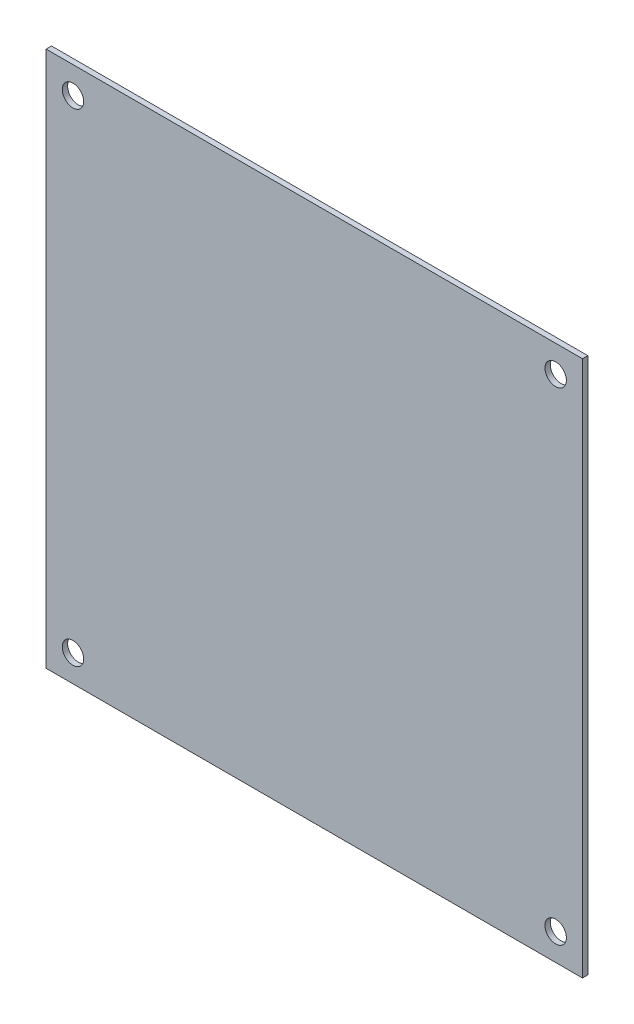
ISO-10303-21;
HEADER;
FILE_DESCRIPTION(('STEP AP214'),'2;1');
FILE_NAME('part.step','',(''),(''),'','','');
FILE_SCHEMA(('AUTOMOTIVE_DESIGN { 1 0 10303 214 1 1 1 1 }'));
ENDSEC;
DATA;
#1=APPLICATION_CONTEXT('core data for automotive mechanical design processes');
#2=APPLICATION_PROTOCOL_DEFINITION('international standard','automotive_design',2000,#1);
#3=PRODUCT_CONTEXT('',#1,'mechanical');
#4=PRODUCT('Part','Part','',(#3));
#5=PRODUCT_RELATED_PRODUCT_CATEGORY('part','',(#4));
#6=PRODUCT_DEFINITION_FORMATION('','',#4);
#7=PRODUCT_DEFINITION_CONTEXT('part definition',#1,'design');
#8=PRODUCT_DEFINITION('design','',#6,#7);
#9=PRODUCT_DEFINITION_SHAPE('','',#8);
#10=(LENGTH_UNIT() NAMED_UNIT(*) SI_UNIT(.MILLI.,.METRE.));
#11=(NAMED_UNIT(*) PLANE_ANGLE_UNIT() SI_UNIT($,.RADIAN.));
#12=(NAMED_UNIT(*) SI_UNIT($,.STERADIAN.) SOLID_ANGLE_UNIT());
#13=UNCERTAINTY_MEASURE_WITH_UNIT(LENGTH_MEASURE(1.E-05),#10,'distance_accuracy_value','');
#14=(GEOMETRIC_REPRESENTATION_CONTEXT(3) GLOBAL_UNCERTAINTY_ASSIGNED_CONTEXT((#13)) GLOBAL_UNIT_ASSIGNED_CONTEXT((#10,
#11,#12)) REPRESENTATION_CONTEXT('',''));
#15=CARTESIAN_POINT('',(0.,0.,0.));
#16=DIRECTION('',(0.,0.,1.));
#17=DIRECTION('',(1.,0.,0.));
#18=AXIS2_PLACEMENT_3D('',#15,#16,#17);
#19=CARTESIAN_POINT('',(0.,0.,5.));
#20=DIRECTION('',(0.,0.,1.));
#21=DIRECTION('',(1.,0.,0.));
#22=AXIS2_PLACEMENT_3D('',#19,#20,#21);
#23=PLANE('',#22);
#24=CARTESIAN_POINT('',(225.,-225.,5.));
#25=DIRECTION('',(0.,0.,1.));
#26=DIRECTION('',(1.,0.,0.));
#27=AXIS2_PLACEMENT_3D('',#24,#25,#26);
#28=CIRCLE('',#27,10.);
#29=CARTESIAN_POINT('',(235.,-225.,5.));
#30=VERTEX_POINT('',#29);
#31=EDGE_CURVE('E142',#30,#30,#28,.T.);
#32=ORIENTED_EDGE('',*,*,#31,.F.);
#33=EDGE_LOOP('',(#32));
#34=FACE_BOUND('',#33,.T.);
#35=CARTESIAN_POINT('',(-225.,225.,5.));
#36=DIRECTION('',(0.,0.,1.));
#37=DIRECTION('',(1.,0.,0.));
#38=AXIS2_PLACEMENT_3D('',#35,#36,#37);
#39=CIRCLE('',#38,10.);
#40=CARTESIAN_POINT('',(-215.,225.,5.));
#41=VERTEX_POINT('',#40);
#42=EDGE_CURVE('E112',#41,#41,#39,.T.);
#43=ORIENTED_EDGE('',*,*,#42,.F.);
#44=EDGE_LOOP('',(#43));
#45=FACE_BOUND('',#44,.T.);
#46=DIRECTION('',(0.,1.,0.));
#47=VECTOR('',#46,1.);
#48=CARTESIAN_POINT('',(250.,250.,5.));
#49=LINE('',#48,#47);
#50=CARTESIAN_POINT('',(250.,-250.,5.));
#51=VERTEX_POINT('',#50);
#52=CARTESIAN_POINT('',(250.,250.,5.));
#53=VERTEX_POINT('',#52);
#54=EDGE_CURVE('E92',#51,#53,#49,.T.);
#55=ORIENTED_EDGE('',*,*,#54,.T.);
#56=DIRECTION('',(-1.,0.,0.));
#57=VECTOR('',#56,1.);
#58=CARTESIAN_POINT('',(-250.,250.,5.));
#59=LINE('',#58,#57);
#60=CARTESIAN_POINT('',(-250.,250.,5.));
#61=VERTEX_POINT('',#60);
#62=EDGE_CURVE('E87',#53,#61,#59,.T.);
#63=ORIENTED_EDGE('',*,*,#62,.T.);
#64=DIRECTION('',(0.,-1.,0.));
#65=VECTOR('',#64,1.);
#66=CARTESIAN_POINT('',(-250.,250.,5.));
#67=LINE('',#66,#65);
#68=CARTESIAN_POINT('',(-250.,-250.,5.));
#69=VERTEX_POINT('',#68);
#70=EDGE_CURVE('E90',#61,#69,#67,.T.);
#71=ORIENTED_EDGE('',*,*,#70,.T.);
#72=DIRECTION('',(1.,0.,0.));
#73=VECTOR('',#72,1.);
#74=CARTESIAN_POINT('',(-250.,-250.,5.));
#75=LINE('',#74,#73);
#76=EDGE_CURVE('E57',#69,#51,#75,.T.);
#77=ORIENTED_EDGE('',*,*,#76,.T.);
#78=EDGE_LOOP('',(#55,#63,#71,#77));
#79=FACE_BOUND('',#78,.T.);
#80=CARTESIAN_POINT('',(225.,225.,5.));
#81=DIRECTION('',(0.,0.,1.));
#82=DIRECTION('',(1.,0.,0.));
#83=AXIS2_PLACEMENT_3D('',#80,#81,#82);
#84=CIRCLE('',#83,10.);
#85=CARTESIAN_POINT('',(235.,225.,5.));
#86=VERTEX_POINT('',#85);
#87=EDGE_CURVE('E134',#86,#86,#84,.T.);
#88=ORIENTED_EDGE('',*,*,#87,.F.);
#89=EDGE_LOOP('',(#88));
#90=FACE_BOUND('',#89,.T.);
#91=CARTESIAN_POINT('',(-225.,-225.,5.));
#92=DIRECTION('',(0.,0.,1.));
#93=DIRECTION('',(1.,0.,0.));
#94=AXIS2_PLACEMENT_3D('',#91,#92,#93);
#95=CIRCLE('',#94,10.);
#96=CARTESIAN_POINT('',(-215.,-225.,5.));
#97=VERTEX_POINT('',#96);
#98=EDGE_CURVE('E150',#97,#97,#95,.T.);
#99=ORIENTED_EDGE('',*,*,#98,.F.);
#100=EDGE_LOOP('',(#99));
#101=FACE_BOUND('',#100,.T.);
#102=ADVANCED_FACE('F39',(#34,#45,#79,#90,#101),#23,.T.);
#103=CARTESIAN_POINT('',(0.,0.,0.));
#104=DIRECTION('',(0.,0.,1.));
#105=DIRECTION('',(1.,0.,0.));
#106=AXIS2_PLACEMENT_3D('',#103,#104,#105);
#107=PLANE('',#106);
#108=DIRECTION('',(0.,1.,0.));
#109=VECTOR('',#108,1.);
#110=CARTESIAN_POINT('',(250.,250.,0.));
#111=LINE('',#110,#109);
#112=CARTESIAN_POINT('',(250.,-250.,0.));
#113=VERTEX_POINT('',#112);
#114=CARTESIAN_POINT('',(250.,250.,0.));
#115=VERTEX_POINT('',#114);
#116=EDGE_CURVE('E108',#113,#115,#111,.T.);
#117=ORIENTED_EDGE('',*,*,#116,.F.);
#118=DIRECTION('',(1.,0.,0.));
#119=VECTOR('',#118,1.);
#120=CARTESIAN_POINT('',(-250.,-250.,0.));
#121=LINE('',#120,#119);
#122=CARTESIAN_POINT('',(-250.,-250.,0.));
#123=VERTEX_POINT('',#122);
#124=EDGE_CURVE('E80',#123,#113,#121,.T.);
#125=ORIENTED_EDGE('',*,*,#124,.F.);
#126=DIRECTION('',(0.,-1.,0.));
#127=VECTOR('',#126,1.);
#128=CARTESIAN_POINT('',(-250.,250.,0.));
#129=LINE('',#128,#127);
#130=CARTESIAN_POINT('',(-250.,250.,0.));
#131=VERTEX_POINT('',#130);
#132=EDGE_CURVE('E74',#131,#123,#129,.T.);
#133=ORIENTED_EDGE('',*,*,#132,.F.);
#134=DIRECTION('',(-1.,0.,0.));
#135=VECTOR('',#134,1.);
#136=CARTESIAN_POINT('',(-250.,250.,0.));
#137=LINE('',#136,#135);
#138=EDGE_CURVE('E97',#115,#131,#137,.T.);
#139=ORIENTED_EDGE('',*,*,#138,.F.);
#140=EDGE_LOOP('',(#117,#125,#133,#139));
#141=FACE_BOUND('',#140,.T.);
#142=CARTESIAN_POINT('',(-225.,225.,0.));
#143=DIRECTION('',(0.,0.,1.));
#144=DIRECTION('',(1.,0.,0.));
#145=AXIS2_PLACEMENT_3D('',#142,#143,#144);
#146=CIRCLE('',#145,10.);
#147=CARTESIAN_POINT('',(-215.,225.,0.));
#148=VERTEX_POINT('',#147);
#149=EDGE_CURVE('E130',#148,#148,#146,.T.);
#150=ORIENTED_EDGE('',*,*,#149,.T.);
#151=EDGE_LOOP('',(#150));
#152=FACE_BOUND('',#151,.T.);
#153=CARTESIAN_POINT('',(225.,225.,0.));
#154=DIRECTION('',(0.,0.,1.));
#155=DIRECTION('',(1.,0.,0.));
#156=AXIS2_PLACEMENT_3D('',#153,#154,#155);
#157=CIRCLE('',#156,10.);
#158=CARTESIAN_POINT('',(235.,225.,0.));
#159=VERTEX_POINT('',#158);
#160=EDGE_CURVE('E138',#159,#159,#157,.T.);
#161=ORIENTED_EDGE('',*,*,#160,.T.);
#162=EDGE_LOOP('',(#161));
#163=FACE_BOUND('',#162,.T.);
#164=CARTESIAN_POINT('',(225.,-225.,0.));
#165=DIRECTION('',(0.,0.,1.));
#166=DIRECTION('',(1.,0.,0.));
#167=AXIS2_PLACEMENT_3D('',#164,#165,#166);
#168=CIRCLE('',#167,10.);
#169=CARTESIAN_POINT('',(235.,-225.,0.));
#170=VERTEX_POINT('',#169);
#171=EDGE_CURVE('E146',#170,#170,#168,.T.);
#172=ORIENTED_EDGE('',*,*,#171,.T.);
#173=EDGE_LOOP('',(#172));
#174=FACE_BOUND('',#173,.T.);
#175=CARTESIAN_POINT('',(-225.,-225.,0.));
#176=DIRECTION('',(0.,0.,1.));
#177=DIRECTION('',(1.,0.,0.));
#178=AXIS2_PLACEMENT_3D('',#175,#176,#177);
#179=CIRCLE('',#178,10.);
#180=CARTESIAN_POINT('',(-215.,-225.,0.));
#181=VERTEX_POINT('',#180);
#182=EDGE_CURVE('E154',#181,#181,#179,.T.);
#183=ORIENTED_EDGE('',*,*,#182,.T.);
#184=EDGE_LOOP('',(#183));
#185=FACE_BOUND('',#184,.T.);
#186=ADVANCED_FACE('F125',(#141,#152,#163,#174,#185),#107,.F.);
#187=CARTESIAN_POINT('',(250.,250.,5.));
#188=DIRECTION('',(-1.,0.,0.));
#189=DIRECTION('',(0.,-1.,0.));
#190=AXIS2_PLACEMENT_3D('',#187,#188,#189);
#191=PLANE('',#190);
#192=ORIENTED_EDGE('',*,*,#116,.T.);
#193=DIRECTION('',(0.,0.,-1.));
#194=VECTOR('',#193,1.);
#195=CARTESIAN_POINT('',(250.,250.,5.));
#196=LINE('',#195,#194);
#197=EDGE_CURVE('E11',#53,#115,#196,.T.);
#198=ORIENTED_EDGE('',*,*,#197,.F.);
#199=ORIENTED_EDGE('',*,*,#54,.F.);
#200=DIRECTION('',(0.,0.,-1.));
#201=VECTOR('',#200,1.);
#202=CARTESIAN_POINT('',(250.,-250.,5.));
#203=LINE('',#202,#201);
#204=EDGE_CURVE('E104',#51,#113,#203,.T.);
#205=ORIENTED_EDGE('',*,*,#204,.T.);
#206=EDGE_LOOP('',(#192,#198,#199,#205));
#207=FACE_BOUND('',#206,.T.);
#208=ADVANCED_FACE('F41',(#207),#191,.F.);
#209=CARTESIAN_POINT('',(-250.,250.,5.));
#210=DIRECTION('',(0.,-1.,0.));
#211=DIRECTION('',(0.,0.,-1.));
#212=AXIS2_PLACEMENT_3D('',#209,#210,#211);
#213=PLANE('',#212);
#214=ORIENTED_EDGE('',*,*,#138,.T.);
#215=DIRECTION('',(0.,0.,-1.));
#216=VECTOR('',#215,1.);
#217=CARTESIAN_POINT('',(-250.,250.,5.));
#218=LINE('',#217,#216);
#219=EDGE_CURVE('E49',#61,#131,#218,.T.);
#220=ORIENTED_EDGE('',*,*,#219,.F.);
#221=ORIENTED_EDGE('',*,*,#62,.F.);
#222=ORIENTED_EDGE('',*,*,#197,.T.);
#223=EDGE_LOOP('',(#214,#220,#221,#222));
#224=FACE_BOUND('',#223,.T.);
#225=ADVANCED_FACE('F96',(#224),#213,.F.);
#226=CARTESIAN_POINT('',(-250.,250.,5.));
#227=DIRECTION('',(1.,0.,0.));
#228=DIRECTION('',(0.,1.,0.));
#229=AXIS2_PLACEMENT_3D('',#226,#227,#228);
#230=PLANE('',#229);
#231=ORIENTED_EDGE('',*,*,#132,.T.);
#232=DIRECTION('',(0.,0.,-1.));
#233=VECTOR('',#232,1.);
#234=CARTESIAN_POINT('',(-250.,-250.,5.));
#235=LINE('',#234,#233);
#236=EDGE_CURVE('E99',#69,#123,#235,.T.);
#237=ORIENTED_EDGE('',*,*,#236,.F.);
#238=ORIENTED_EDGE('',*,*,#70,.F.);
#239=ORIENTED_EDGE('',*,*,#219,.T.);
#240=EDGE_LOOP('',(#231,#237,#238,#239));
#241=FACE_BOUND('',#240,.T.);
#242=ADVANCED_FACE('F100',(#241),#230,.F.);
#243=CARTESIAN_POINT('',(-250.,-250.,5.));
#244=DIRECTION('',(0.,1.,0.));
#245=DIRECTION('',(0.,0.,1.));
#246=AXIS2_PLACEMENT_3D('',#243,#244,#245);
#247=PLANE('',#246);
#248=ORIENTED_EDGE('',*,*,#124,.T.);
#249=ORIENTED_EDGE('',*,*,#204,.F.);
#250=ORIENTED_EDGE('',*,*,#76,.F.);
#251=ORIENTED_EDGE('',*,*,#236,.T.);
#252=EDGE_LOOP('',(#248,#249,#250,#251));
#253=FACE_BOUND('',#252,.T.);
#254=ADVANCED_FACE('F122',(#253),#247,.F.);
#255=CARTESIAN_POINT('',(-225.,225.,5.));
#256=DIRECTION('',(0.,0.,-1.));
#257=DIRECTION('',(-1.,0.,0.));
#258=AXIS2_PLACEMENT_3D('',#255,#256,#257);
#259=CYLINDRICAL_SURFACE('',#258,10.);
#260=ORIENTED_EDGE('',*,*,#42,.T.);
#261=EDGE_LOOP('',(#260));
#262=FACE_BOUND('',#261,.T.);
#263=ORIENTED_EDGE('',*,*,#149,.F.);
#264=EDGE_LOOP('',(#263));
#265=FACE_BOUND('',#264,.T.);
#266=ADVANCED_FACE('F175',(#262,#265),#259,.F.);
#267=CARTESIAN_POINT('',(225.,225.,5.));
#268=DIRECTION('',(0.,0.,-1.));
#269=DIRECTION('',(-1.,0.,0.));
#270=AXIS2_PLACEMENT_3D('',#267,#268,#269);
#271=CYLINDRICAL_SURFACE('',#270,10.);
#272=ORIENTED_EDGE('',*,*,#87,.T.);
#273=EDGE_LOOP('',(#272));
#274=FACE_BOUND('',#273,.T.);
#275=ORIENTED_EDGE('',*,*,#160,.F.);
#276=EDGE_LOOP('',(#275));
#277=FACE_BOUND('',#276,.T.);
#278=ADVANCED_FACE('F221',(#274,#277),#271,.F.);
#279=CARTESIAN_POINT('',(225.,-225.,5.));
#280=DIRECTION('',(0.,0.,-1.));
#281=DIRECTION('',(-1.,0.,0.));
#282=AXIS2_PLACEMENT_3D('',#279,#280,#281);
#283=CYLINDRICAL_SURFACE('',#282,10.);
#284=ORIENTED_EDGE('',*,*,#31,.T.);
#285=EDGE_LOOP('',(#284));
#286=FACE_BOUND('',#285,.T.);
#287=ORIENTED_EDGE('',*,*,#171,.F.);
#288=EDGE_LOOP('',(#287));
#289=FACE_BOUND('',#288,.T.);
#290=ADVANCED_FACE('F229',(#286,#289),#283,.F.);
#291=CARTESIAN_POINT('',(-225.,-225.,5.));
#292=DIRECTION('',(0.,0.,-1.));
#293=DIRECTION('',(-1.,0.,0.));
#294=AXIS2_PLACEMENT_3D('',#291,#292,#293);
#295=CYLINDRICAL_SURFACE('',#294,10.);
#296=ORIENTED_EDGE('',*,*,#98,.T.);
#297=EDGE_LOOP('',(#296));
#298=FACE_BOUND('',#297,.T.);
#299=ORIENTED_EDGE('',*,*,#182,.F.);
#300=EDGE_LOOP('',(#299));
#301=FACE_BOUND('',#300,.T.);
#302=ADVANCED_FACE('F162',(#298,#301),#295,.F.);
#303=CLOSED_SHELL('',(#102,#186,#208,#225,#242,#254,#266,#278,#290,#302));
#304=MANIFOLD_SOLID_BREP('B2',#303);
#305=ADVANCED_BREP_SHAPE_REPRESENTATION('',(#18,#304),#14);
#306=SHAPE_DEFINITION_REPRESENTATION(#9,#305);
ENDSEC;
END-ISO-10303-21;
